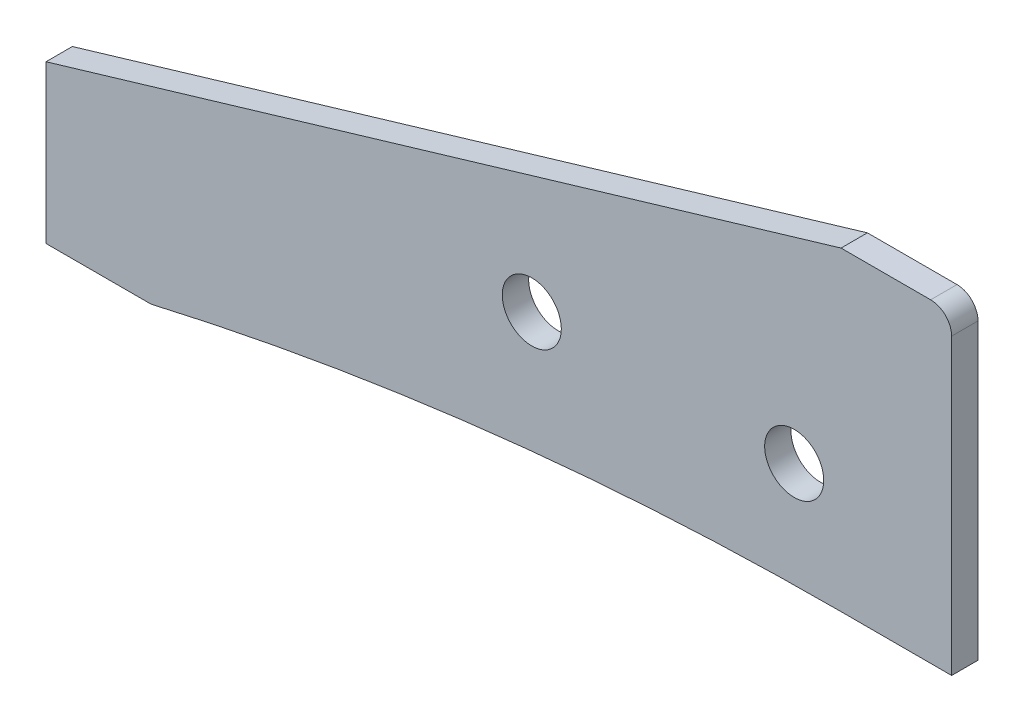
from build123d import *

# Parameters (mm, degrees)
BOSS_EXTRUDE1_DEPTH             = 3.19024
F_9_32_0_28125_DIAMETER_HOLE1_D = 7.14375


with BuildPart() as part:
    # Sketch1 → Boss-Extrude1 (new body)
    with BuildSketch(Plane.XY):
        with BuildLine():
            Line((-2.54, 0), (-13.382100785, 0))
            Line((-13.382100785, 0), (-109.580516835, -28.575))
            Line((-109.580516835, -28.575), (-109.580516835, -47.625))
            Line((-109.580516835, -47.625), (-96.880516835, -47.625))
            ThreePointArc((-96.880516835, -47.625), (-55.402069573, -40.488946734), (-13.382100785, -38.1))
            Line((-13.382100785, -38.1), (0, -38.1))
            Line((0, -38.1), (0, -2.54))
            ThreePointArc((0, -2.54), (-0.743948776, -0.743948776), (-2.54, 0))
        make_face()
    extrude(amount=-BOSS_EXTRUDE1_DEPTH)

    # 9_32 _0.28125_ Diameter Hole1 (through all)
    with Locations(Plane.XY):
        with Locations((-19.05, -25.4), (-50.8, -25.4)):
            Hole(F_9_32_0_28125_DIAMETER_HOLE1_D / 2)


solid = part.part
